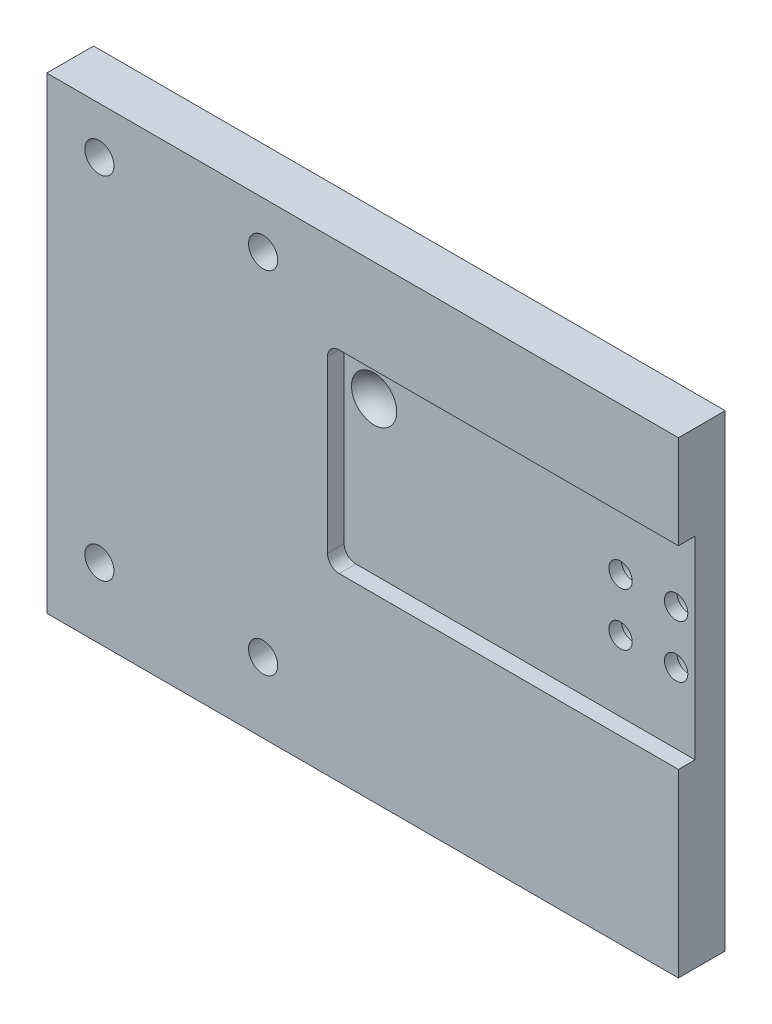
ISO-10303-21;
HEADER;
FILE_DESCRIPTION(('STEP AP214'),'2;1');
FILE_NAME('part.step','',(''),(''),'','','');
FILE_SCHEMA(('AUTOMOTIVE_DESIGN { 1 0 10303 214 1 1 1 1 }'));
ENDSEC;
DATA;
#1=APPLICATION_CONTEXT('core data for automotive mechanical design processes');
#2=APPLICATION_PROTOCOL_DEFINITION('international standard','automotive_design',2000,#1);
#3=PRODUCT_CONTEXT('',#1,'mechanical');
#4=PRODUCT('Part','Part','',(#3));
#5=PRODUCT_RELATED_PRODUCT_CATEGORY('part','',(#4));
#6=PRODUCT_DEFINITION_FORMATION('','',#4);
#7=PRODUCT_DEFINITION_CONTEXT('part definition',#1,'design');
#8=PRODUCT_DEFINITION('design','',#6,#7);
#9=PRODUCT_DEFINITION_SHAPE('','',#8);
#10=(LENGTH_UNIT() NAMED_UNIT(*) SI_UNIT(.MILLI.,.METRE.));
#11=(NAMED_UNIT(*) PLANE_ANGLE_UNIT() SI_UNIT($,.RADIAN.));
#12=(NAMED_UNIT(*) SI_UNIT($,.STERADIAN.) SOLID_ANGLE_UNIT());
#13=UNCERTAINTY_MEASURE_WITH_UNIT(LENGTH_MEASURE(1.E-05),#10,'distance_accuracy_value','');
#14=(GEOMETRIC_REPRESENTATION_CONTEXT(3) GLOBAL_UNCERTAINTY_ASSIGNED_CONTEXT((#13)) GLOBAL_UNIT_ASSIGNED_CONTEXT((#10,
#11,#12)) REPRESENTATION_CONTEXT('',''));
#15=CARTESIAN_POINT('',(0.,0.,0.));
#16=DIRECTION('',(0.,0.,1.));
#17=DIRECTION('',(1.,0.,0.));
#18=AXIS2_PLACEMENT_3D('',#15,#16,#17);
#19=CARTESIAN_POINT('',(0.,0.,1.8288));
#20=DIRECTION('',(0.,0.,-1.));
#21=DIRECTION('',(-1.,0.,0.));
#22=AXIS2_PLACEMENT_3D('',#19,#20,#21);
#23=PLANE('',#22);
#24=DIRECTION('',(0.,-1.,0.));
#25=VECTOR('',#24,1.);
#26=CARTESIAN_POINT('',(76.2,49.022,1.8288));
#27=LINE('',#26,#25);
#28=CARTESIAN_POINT('',(76.2,98.425,1.8288));
#29=VERTEX_POINT('',#28);
#30=CARTESIAN_POINT('',(76.2,52.197,1.8288));
#31=VERTEX_POINT('',#30);
#32=EDGE_CURVE('E116',#29,#31,#27,.T.);
#33=ORIENTED_EDGE('',*,*,#32,.T.);
#34=CARTESIAN_POINT('',(79.375,52.197,1.8288));
#35=DIRECTION('',(0.,0.,-1.));
#36=DIRECTION('',(-1.,0.,0.));
#37=AXIS2_PLACEMENT_3D('',#34,#35,#36);
#38=CIRCLE('',#37,3.175);
#39=CARTESIAN_POINT('',(79.375,49.022,1.8288));
#40=VERTEX_POINT('',#39);
#41=EDGE_CURVE('E228',#31,#40,#38,.F.);
#42=ORIENTED_EDGE('',*,*,#41,.T.);
#43=DIRECTION('',(1.,0.,0.));
#44=VECTOR('',#43,1.);
#45=CARTESIAN_POINT('',(171.45,49.022,1.8288));
#46=LINE('',#45,#44);
#47=CARTESIAN_POINT('',(171.45,49.022,1.8288));
#48=VERTEX_POINT('',#47);
#49=EDGE_CURVE('E123',#40,#48,#46,.T.);
#50=ORIENTED_EDGE('',*,*,#49,.T.);
#51=DIRECTION('',(0.,1.,0.));
#52=VECTOR('',#51,1.);
#53=CARTESIAN_POINT('',(171.45,49.022,1.8288));
#54=LINE('',#53,#52);
#55=CARTESIAN_POINT('',(171.45,101.6,1.8288));
#56=VERTEX_POINT('',#55);
#57=EDGE_CURVE('E117',#48,#56,#54,.T.);
#58=ORIENTED_EDGE('',*,*,#57,.T.);
#59=DIRECTION('',(-1.,0.,0.));
#60=VECTOR('',#59,1.);
#61=CARTESIAN_POINT('',(76.2,101.6,1.8288));
#62=LINE('',#61,#60);
#63=CARTESIAN_POINT('',(79.375,101.6,1.8288));
#64=VERTEX_POINT('',#63);
#65=EDGE_CURVE('E109',#56,#64,#62,.T.);
#66=ORIENTED_EDGE('',*,*,#65,.T.);
#67=CARTESIAN_POINT('',(79.375,98.425,1.8288));
#68=DIRECTION('',(0.,0.,-1.));
#69=DIRECTION('',(-1.,0.,0.));
#70=AXIS2_PLACEMENT_3D('',#67,#68,#69);
#71=CIRCLE('',#70,3.175);
#72=EDGE_CURVE('E226',#64,#29,#71,.F.);
#73=ORIENTED_EDGE('',*,*,#72,.T.);
#74=EDGE_LOOP('',(#33,#42,#50,#58,#66,#73));
#75=FACE_BOUND('',#74,.T.);
#76=CARTESIAN_POINT('',(151.2062,82.4484,1.8288));
#77=DIRECTION('',(0.,0.,-1.));
#78=DIRECTION('',(-1.,0.,0.));
#79=AXIS2_PLACEMENT_3D('',#76,#77,#78);
#80=CIRCLE('',#79,3.175);
#81=CARTESIAN_POINT('',(148.0312,82.4484,1.8288));
#82=VERTEX_POINT('',#81);
#83=EDGE_CURVE('E135',#82,#82,#80,.T.);
#84=ORIENTED_EDGE('',*,*,#83,.T.);
#85=EDGE_LOOP('',(#84));
#86=FACE_BOUND('',#85,.T.);
#87=CARTESIAN_POINT('',(166.2938,82.4484,1.8288));
#88=DIRECTION('',(0.,0.,-1.));
#89=DIRECTION('',(-1.,0.,0.));
#90=AXIS2_PLACEMENT_3D('',#87,#88,#89);
#91=CIRCLE('',#90,3.17499999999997);
#92=CARTESIAN_POINT('',(163.1188,82.4484,1.8288));
#93=VERTEX_POINT('',#92);
#94=EDGE_CURVE('E140',#93,#93,#91,.T.);
#95=ORIENTED_EDGE('',*,*,#94,.T.);
#96=EDGE_LOOP('',(#95));
#97=FACE_BOUND('',#96,.T.);
#98=CARTESIAN_POINT('',(166.2938,68.1736,1.8288));
#99=DIRECTION('',(0.,0.,-1.));
#100=DIRECTION('',(-1.,0.,0.));
#101=AXIS2_PLACEMENT_3D('',#98,#99,#100);
#102=CIRCLE('',#101,3.17499999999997);
#103=CARTESIAN_POINT('',(163.1188,68.1736,1.8288));
#104=VERTEX_POINT('',#103);
#105=EDGE_CURVE('E143',#104,#104,#102,.T.);
#106=ORIENTED_EDGE('',*,*,#105,.T.);
#107=EDGE_LOOP('',(#106));
#108=FACE_BOUND('',#107,.T.);
#109=CARTESIAN_POINT('',(151.2062,68.1736,1.8288));
#110=DIRECTION('',(0.,0.,-1.));
#111=DIRECTION('',(-1.,0.,0.));
#112=AXIS2_PLACEMENT_3D('',#109,#110,#111);
#113=CIRCLE('',#112,3.175);
#114=CARTESIAN_POINT('',(148.0312,68.1736,1.8288));
#115=VERTEX_POINT('',#114);
#116=EDGE_CURVE('E146',#115,#115,#113,.T.);
#117=ORIENTED_EDGE('',*,*,#116,.T.);
#118=EDGE_LOOP('',(#117));
#119=FACE_BOUND('',#118,.T.);
#120=CARTESIAN_POINT('',(84.328,90.3097,1.8288));
#121=DIRECTION('',(0.,0.,-1.));
#122=DIRECTION('',(-1.,0.,0.));
#123=AXIS2_PLACEMENT_3D('',#120,#121,#122);
#124=CIRCLE('',#123,6.13377131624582);
#125=CARTESIAN_POINT('',(78.1942286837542,90.3097,1.8288));
#126=VERTEX_POINT('',#125);
#127=EDGE_CURVE('E37',#126,#126,#124,.F.);
#128=ORIENTED_EDGE('',*,*,#127,.F.);
#129=EDGE_LOOP('',(#128));
#130=FACE_BOUND('',#129,.T.);
#131=ADVANCED_FACE('F33',(#75,#86,#97,#108,#119,#130),#23,.F.);
#132=CARTESIAN_POINT('',(151.2062,82.4484,6.35));
#133=DIRECTION('',(0.,0.,-1.));
#134=DIRECTION('',(-1.,0.,0.));
#135=AXIS2_PLACEMENT_3D('',#132,#133,#134);
#136=CYLINDRICAL_SURFACE('',#135,3.175);
#137=ORIENTED_EDGE('',*,*,#83,.F.);
#138=EDGE_LOOP('',(#137));
#139=FACE_BOUND('',#138,.T.);
#140=CARTESIAN_POINT('',(151.2062,82.4484,-1.5748));
#141=DIRECTION('',(0.,0.,-1.));
#142=DIRECTION('',(-1.,0.,0.));
#143=AXIS2_PLACEMENT_3D('',#140,#141,#142);
#144=CIRCLE('',#143,3.175);
#145=CARTESIAN_POINT('',(148.0312,82.4484,-1.5748));
#146=VERTEX_POINT('',#145);
#147=EDGE_CURVE('E250',#146,#146,#144,.T.);
#148=ORIENTED_EDGE('',*,*,#147,.T.);
#149=EDGE_LOOP('',(#148));
#150=FACE_BOUND('',#149,.T.);
#151=ADVANCED_FACE('F291',(#139,#150),#136,.F.);
#152=CARTESIAN_POINT('',(166.2938,82.4484,6.35));
#153=DIRECTION('',(0.,0.,-1.));
#154=DIRECTION('',(-1.,0.,0.));
#155=AXIS2_PLACEMENT_3D('',#152,#153,#154);
#156=CYLINDRICAL_SURFACE('',#155,3.17499999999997);
#157=ORIENTED_EDGE('',*,*,#94,.F.);
#158=EDGE_LOOP('',(#157));
#159=FACE_BOUND('',#158,.T.);
#160=CARTESIAN_POINT('',(166.2938,82.4484,-1.5748));
#161=DIRECTION('',(0.,0.,-1.));
#162=DIRECTION('',(-1.,0.,0.));
#163=AXIS2_PLACEMENT_3D('',#160,#161,#162);
#164=CIRCLE('',#163,3.17499999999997);
#165=CARTESIAN_POINT('',(163.1188,82.4484,-1.5748));
#166=VERTEX_POINT('',#165);
#167=EDGE_CURVE('E245',#166,#166,#164,.T.);
#168=ORIENTED_EDGE('',*,*,#167,.T.);
#169=EDGE_LOOP('',(#168));
#170=FACE_BOUND('',#169,.T.);
#171=ADVANCED_FACE('F296',(#159,#170),#156,.F.);
#172=CARTESIAN_POINT('',(166.2938,68.1736,6.35));
#173=DIRECTION('',(0.,0.,-1.));
#174=DIRECTION('',(-1.,0.,0.));
#175=AXIS2_PLACEMENT_3D('',#172,#173,#174);
#176=CYLINDRICAL_SURFACE('',#175,3.17499999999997);
#177=ORIENTED_EDGE('',*,*,#105,.F.);
#178=EDGE_LOOP('',(#177));
#179=FACE_BOUND('',#178,.T.);
#180=CARTESIAN_POINT('',(166.2938,68.1736,-1.5748));
#181=DIRECTION('',(0.,0.,-1.));
#182=DIRECTION('',(-1.,0.,0.));
#183=AXIS2_PLACEMENT_3D('',#180,#181,#182);
#184=CIRCLE('',#183,3.17499999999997);
#185=CARTESIAN_POINT('',(163.1188,68.1736,-1.5748));
#186=VERTEX_POINT('',#185);
#187=EDGE_CURVE('E240',#186,#186,#184,.T.);
#188=ORIENTED_EDGE('',*,*,#187,.T.);
#189=EDGE_LOOP('',(#188));
#190=FACE_BOUND('',#189,.T.);
#191=ADVANCED_FACE('F347',(#179,#190),#176,.F.);
#192=CARTESIAN_POINT('',(151.2062,68.1736,6.35));
#193=DIRECTION('',(0.,0.,-1.));
#194=DIRECTION('',(-1.,0.,0.));
#195=AXIS2_PLACEMENT_3D('',#192,#193,#194);
#196=CYLINDRICAL_SURFACE('',#195,3.175);
#197=ORIENTED_EDGE('',*,*,#116,.F.);
#198=EDGE_LOOP('',(#197));
#199=FACE_BOUND('',#198,.T.);
#200=CARTESIAN_POINT('',(151.2062,68.1736,-1.5748));
#201=DIRECTION('',(0.,0.,-1.));
#202=DIRECTION('',(-1.,0.,0.));
#203=AXIS2_PLACEMENT_3D('',#200,#201,#202);
#204=CIRCLE('',#203,3.175);
#205=CARTESIAN_POINT('',(148.0312,68.1736,-1.5748));
#206=VERTEX_POINT('',#205);
#207=EDGE_CURVE('E235',#206,#206,#204,.T.);
#208=ORIENTED_EDGE('',*,*,#207,.T.);
#209=EDGE_LOOP('',(#208));
#210=FACE_BOUND('',#209,.T.);
#211=ADVANCED_FACE('F351',(#199,#210),#196,.F.);
#212=CARTESIAN_POINT('',(0.,0.,6.35));
#213=DIRECTION('',(0.,0.,1.));
#214=DIRECTION('',(1.,0.,0.));
#215=AXIS2_PLACEMENT_3D('',#212,#213,#214);
#216=PLANE('',#215);
#217=DIRECTION('',(1.,0.,0.));
#218=VECTOR('',#217,1.);
#219=CARTESIAN_POINT('',(171.45,49.022,6.35));
#220=LINE('',#219,#218);
#221=CARTESIAN_POINT('',(79.375,49.022,6.35));
#222=VERTEX_POINT('',#221);
#223=CARTESIAN_POINT('',(171.45,49.022,6.35));
#224=VERTEX_POINT('',#223);
#225=EDGE_CURVE('E127',#222,#224,#220,.T.);
#226=ORIENTED_EDGE('',*,*,#225,.F.);
#227=CARTESIAN_POINT('',(79.375,52.197,6.35));
#228=DIRECTION('',(0.,0.,1.));
#229=DIRECTION('',(1.,0.,0.));
#230=AXIS2_PLACEMENT_3D('',#227,#228,#229);
#231=CIRCLE('',#230,3.175);
#232=CARTESIAN_POINT('',(76.2,52.197,6.35));
#233=VERTEX_POINT('',#232);
#234=EDGE_CURVE('E231',#222,#233,#231,.F.);
#235=ORIENTED_EDGE('',*,*,#234,.T.);
#236=DIRECTION('',(0.,-1.,0.));
#237=VECTOR('',#236,1.);
#238=CARTESIAN_POINT('',(76.2,49.022,6.35));
#239=LINE('',#238,#237);
#240=CARTESIAN_POINT('',(76.2,98.425,6.35));
#241=VERTEX_POINT('',#240);
#242=EDGE_CURVE('E432',#241,#233,#239,.T.);
#243=ORIENTED_EDGE('',*,*,#242,.F.);
#244=CARTESIAN_POINT('',(79.375,98.425,6.35));
#245=DIRECTION('',(0.,0.,1.));
#246=DIRECTION('',(1.,0.,0.));
#247=AXIS2_PLACEMENT_3D('',#244,#245,#246);
#248=CIRCLE('',#247,3.175);
#249=CARTESIAN_POINT('',(79.375,101.6,6.35));
#250=VERTEX_POINT('',#249);
#251=EDGE_CURVE('E49',#241,#250,#248,.F.);
#252=ORIENTED_EDGE('',*,*,#251,.T.);
#253=DIRECTION('',(-1.,0.,0.));
#254=VECTOR('',#253,1.);
#255=CARTESIAN_POINT('',(76.2,101.6,6.35));
#256=LINE('',#255,#254);
#257=CARTESIAN_POINT('',(171.45,101.6,6.35));
#258=VERTEX_POINT('',#257);
#259=EDGE_CURVE('E238',#258,#250,#256,.T.);
#260=ORIENTED_EDGE('',*,*,#259,.F.);
#261=DIRECTION('',(0.,1.,0.));
#262=VECTOR('',#261,1.);
#263=CARTESIAN_POINT('',(171.45,0.,6.35));
#264=LINE('',#263,#262);
#265=CARTESIAN_POINT('',(171.45,127.,6.35));
#266=VERTEX_POINT('',#265);
#267=EDGE_CURVE('E132',#258,#266,#264,.T.);
#268=ORIENTED_EDGE('',*,*,#267,.T.);
#269=DIRECTION('',(-1.,0.,0.));
#270=VECTOR('',#269,1.);
#271=CARTESIAN_POINT('',(171.45,127.,6.35));
#272=LINE('',#271,#270);
#273=CARTESIAN_POINT('',(0.,127.,6.35));
#274=VERTEX_POINT('',#273);
#275=EDGE_CURVE('E195',#266,#274,#272,.T.);
#276=ORIENTED_EDGE('',*,*,#275,.T.);
#277=DIRECTION('',(0.,-1.,0.));
#278=VECTOR('',#277,1.);
#279=CARTESIAN_POINT('',(0.,127.,6.35));
#280=LINE('',#279,#278);
#281=CARTESIAN_POINT('',(0.,0.,6.35));
#282=VERTEX_POINT('',#281);
#283=EDGE_CURVE('E186',#274,#282,#280,.T.);
#284=ORIENTED_EDGE('',*,*,#283,.T.);
#285=DIRECTION('',(1.,0.,0.));
#286=VECTOR('',#285,1.);
#287=CARTESIAN_POINT('',(0.,0.,6.35));
#288=LINE('',#287,#286);
#289=CARTESIAN_POINT('',(171.45,0.,6.35));
#290=VERTEX_POINT('',#289);
#291=EDGE_CURVE('E189',#282,#290,#288,.T.);
#292=ORIENTED_EDGE('',*,*,#291,.T.);
#293=EDGE_CURVE('E192',#290,#224,#264,.T.);
#294=ORIENTED_EDGE('',*,*,#293,.T.);
#295=EDGE_LOOP('',(#226,#235,#243,#252,#260,#268,#276,#284,#292,#294));
#296=FACE_BOUND('',#295,.T.);
#297=CARTESIAN_POINT('',(58.7248,114.3,6.35));
#298=DIRECTION('',(0.,0.,1.));
#299=DIRECTION('',(1.,0.,0.));
#300=AXIS2_PLACEMENT_3D('',#297,#298,#299);
#301=CIRCLE('',#300,3.9624);
#302=CARTESIAN_POINT('',(62.6872,114.3,6.35));
#303=VERTEX_POINT('',#302);
#304=EDGE_CURVE('E168',#303,#303,#301,.T.);
#305=ORIENTED_EDGE('',*,*,#304,.F.);
#306=EDGE_LOOP('',(#305));
#307=FACE_BOUND('',#306,.T.);
#308=CARTESIAN_POINT('',(14.2748,19.05,6.35));
#309=DIRECTION('',(0.,0.,1.));
#310=DIRECTION('',(1.,0.,0.));
#311=AXIS2_PLACEMENT_3D('',#308,#309,#310);
#312=CIRCLE('',#311,3.9624);
#313=CARTESIAN_POINT('',(18.2372,19.05,6.35));
#314=VERTEX_POINT('',#313);
#315=EDGE_CURVE('E180',#314,#314,#312,.T.);
#316=ORIENTED_EDGE('',*,*,#315,.F.);
#317=EDGE_LOOP('',(#316));
#318=FACE_BOUND('',#317,.T.);
#319=CARTESIAN_POINT('',(58.7248,19.05,6.35));
#320=DIRECTION('',(0.,0.,1.));
#321=DIRECTION('',(1.,0.,0.));
#322=AXIS2_PLACEMENT_3D('',#319,#320,#321);
#323=CIRCLE('',#322,3.9624);
#324=CARTESIAN_POINT('',(62.6872,19.05,6.35));
#325=VERTEX_POINT('',#324);
#326=EDGE_CURVE('E174',#325,#325,#323,.T.);
#327=ORIENTED_EDGE('',*,*,#326,.F.);
#328=EDGE_LOOP('',(#327));
#329=FACE_BOUND('',#328,.T.);
#330=CARTESIAN_POINT('',(14.2748,114.3,6.35));
#331=DIRECTION('',(0.,0.,1.));
#332=DIRECTION('',(1.,0.,0.));
#333=AXIS2_PLACEMENT_3D('',#330,#331,#332);
#334=CIRCLE('',#333,3.9624);
#335=CARTESIAN_POINT('',(18.2372,114.3,6.35));
#336=VERTEX_POINT('',#335);
#337=EDGE_CURVE('E162',#336,#336,#334,.T.);
#338=ORIENTED_EDGE('',*,*,#337,.F.);
#339=EDGE_LOOP('',(#338));
#340=FACE_BOUND('',#339,.T.);
#341=ADVANCED_FACE('F355',(#296,#307,#318,#329,#340),#216,.T.);
#342=CARTESIAN_POINT('',(0.,0.,-6.35));
#343=DIRECTION('',(0.,0.,1.));
#344=DIRECTION('',(1.,0.,0.));
#345=AXIS2_PLACEMENT_3D('',#342,#343,#344);
#346=PLANE('',#345);
#347=CARTESIAN_POINT('',(151.2062,82.4484,-6.35));
#348=DIRECTION('',(0.,0.,-1.));
#349=DIRECTION('',(-1.,0.,0.));
#350=AXIS2_PLACEMENT_3D('',#347,#348,#349);
#351=CIRCLE('',#350,4.76250000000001);
#352=CARTESIAN_POINT('',(146.4437,82.4484,-6.35));
#353=VERTEX_POINT('',#352);
#354=EDGE_CURVE('E455',#353,#353,#351,.T.);
#355=ORIENTED_EDGE('',*,*,#354,.F.);
#356=EDGE_LOOP('',(#355));
#357=FACE_BOUND('',#356,.T.);
#358=CARTESIAN_POINT('',(166.2938,82.4484,-6.35));
#359=DIRECTION('',(0.,0.,-1.));
#360=DIRECTION('',(-1.,0.,0.));
#361=AXIS2_PLACEMENT_3D('',#358,#359,#360);
#362=CIRCLE('',#361,4.76250000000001);
#363=CARTESIAN_POINT('',(161.5313,82.4484,-6.35));
#364=VERTEX_POINT('',#363);
#365=EDGE_CURVE('E253',#364,#364,#362,.T.);
#366=ORIENTED_EDGE('',*,*,#365,.F.);
#367=EDGE_LOOP('',(#366));
#368=FACE_BOUND('',#367,.T.);
#369=CARTESIAN_POINT('',(166.2938,68.1736,-6.35));
#370=DIRECTION('',(0.,0.,-1.));
#371=DIRECTION('',(-1.,0.,0.));
#372=AXIS2_PLACEMENT_3D('',#369,#370,#371);
#373=CIRCLE('',#372,4.76250000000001);
#374=CARTESIAN_POINT('',(161.5313,68.1736,-6.35));
#375=VERTEX_POINT('',#374);
#376=EDGE_CURVE('E248',#375,#375,#373,.T.);
#377=ORIENTED_EDGE('',*,*,#376,.F.);
#378=EDGE_LOOP('',(#377));
#379=FACE_BOUND('',#378,.T.);
#380=CARTESIAN_POINT('',(151.2062,68.1736,-6.35));
#381=DIRECTION('',(0.,0.,-1.));
#382=DIRECTION('',(-1.,0.,0.));
#383=AXIS2_PLACEMENT_3D('',#380,#381,#382);
#384=CIRCLE('',#383,4.76250000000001);
#385=CARTESIAN_POINT('',(146.4437,68.1736,-6.35));
#386=VERTEX_POINT('',#385);
#387=EDGE_CURVE('E243',#386,#386,#384,.T.);
#388=ORIENTED_EDGE('',*,*,#387,.F.);
#389=EDGE_LOOP('',(#388));
#390=FACE_BOUND('',#389,.T.);
#391=CARTESIAN_POINT('',(58.7248,114.3,-6.35));
#392=DIRECTION('',(0.,0.,1.));
#393=DIRECTION('',(1.,0.,0.));
#394=AXIS2_PLACEMENT_3D('',#391,#392,#393);
#395=CIRCLE('',#394,3.9624);
#396=CARTESIAN_POINT('',(62.6872,114.3,-6.35));
#397=VERTEX_POINT('',#396);
#398=EDGE_CURVE('E165',#397,#397,#395,.T.);
#399=ORIENTED_EDGE('',*,*,#398,.T.);
#400=EDGE_LOOP('',(#399));
#401=FACE_BOUND('',#400,.T.);
#402=CARTESIAN_POINT('',(14.2748,19.05,-6.35));
#403=DIRECTION('',(0.,0.,1.));
#404=DIRECTION('',(1.,0.,0.));
#405=AXIS2_PLACEMENT_3D('',#402,#403,#404);
#406=CIRCLE('',#405,3.9624);
#407=CARTESIAN_POINT('',(18.2372,19.05,-6.35));
#408=VERTEX_POINT('',#407);
#409=EDGE_CURVE('E177',#408,#408,#406,.T.);
#410=ORIENTED_EDGE('',*,*,#409,.T.);
#411=EDGE_LOOP('',(#410));
#412=FACE_BOUND('',#411,.T.);
#413=DIRECTION('',(0.,-1.,0.));
#414=VECTOR('',#413,1.);
#415=CARTESIAN_POINT('',(0.,127.,-6.35));
#416=LINE('',#415,#414);
#417=CARTESIAN_POINT('',(0.,127.,-6.35));
#418=VERTEX_POINT('',#417);
#419=CARTESIAN_POINT('',(0.,0.,-6.35));
#420=VERTEX_POINT('',#419);
#421=EDGE_CURVE('E183',#418,#420,#416,.T.);
#422=ORIENTED_EDGE('',*,*,#421,.F.);
#423=DIRECTION('',(-1.,0.,0.));
#424=VECTOR('',#423,1.);
#425=CARTESIAN_POINT('',(171.45,127.,-6.35));
#426=LINE('',#425,#424);
#427=CARTESIAN_POINT('',(171.45,127.,-6.35));
#428=VERTEX_POINT('',#427);
#429=EDGE_CURVE('E190',#428,#418,#426,.T.);
#430=ORIENTED_EDGE('',*,*,#429,.F.);
#431=DIRECTION('',(0.,1.,0.));
#432=VECTOR('',#431,1.);
#433=CARTESIAN_POINT('',(171.45,0.,-6.35));
#434=LINE('',#433,#432);
#435=CARTESIAN_POINT('',(171.45,0.,-6.35));
#436=VERTEX_POINT('',#435);
#437=EDGE_CURVE('E202',#436,#428,#434,.T.);
#438=ORIENTED_EDGE('',*,*,#437,.F.);
#439=DIRECTION('',(1.,0.,0.));
#440=VECTOR('',#439,1.);
#441=CARTESIAN_POINT('',(0.,0.,-6.35));
#442=LINE('',#441,#440);
#443=EDGE_CURVE('E200',#420,#436,#442,.T.);
#444=ORIENTED_EDGE('',*,*,#443,.F.);
#445=EDGE_LOOP('',(#422,#430,#438,#444));
#446=FACE_BOUND('',#445,.T.);
#447=CARTESIAN_POINT('',(58.7248,19.05,-6.35));
#448=DIRECTION('',(0.,0.,1.));
#449=DIRECTION('',(1.,0.,0.));
#450=AXIS2_PLACEMENT_3D('',#447,#448,#449);
#451=CIRCLE('',#450,3.9624);
#452=CARTESIAN_POINT('',(62.6872,19.05,-6.35));
#453=VERTEX_POINT('',#452);
#454=EDGE_CURVE('E171',#453,#453,#451,.T.);
#455=ORIENTED_EDGE('',*,*,#454,.T.);
#456=EDGE_LOOP('',(#455));
#457=FACE_BOUND('',#456,.T.);
#458=CARTESIAN_POINT('',(14.2748,114.3,-6.35));
#459=DIRECTION('',(0.,0.,1.));
#460=DIRECTION('',(1.,0.,0.));
#461=AXIS2_PLACEMENT_3D('',#458,#459,#460);
#462=CIRCLE('',#461,3.9624);
#463=CARTESIAN_POINT('',(18.2372,114.3,-6.35));
#464=VERTEX_POINT('',#463);
#465=EDGE_CURVE('E161',#464,#464,#462,.T.);
#466=ORIENTED_EDGE('',*,*,#465,.T.);
#467=EDGE_LOOP('',(#466));
#468=FACE_BOUND('',#467,.T.);
#469=ADVANCED_FACE('F375',(#357,#368,#379,#390,#401,#412,#446,#457,#468),#346,.F.);
#470=CARTESIAN_POINT('',(0.,127.,6.35));
#471=DIRECTION('',(1.,0.,0.));
#472=DIRECTION('',(0.,0.,-1.));
#473=AXIS2_PLACEMENT_3D('',#470,#471,#472);
#474=PLANE('',#473);
#475=ORIENTED_EDGE('',*,*,#421,.T.);
#476=DIRECTION('',(0.,0.,-1.));
#477=VECTOR('',#476,1.);
#478=CARTESIAN_POINT('',(0.,0.,6.35));
#479=LINE('',#478,#477);
#480=EDGE_CURVE('E213',#282,#420,#479,.T.);
#481=ORIENTED_EDGE('',*,*,#480,.F.);
#482=ORIENTED_EDGE('',*,*,#283,.F.);
#483=DIRECTION('',(0.,0.,-1.));
#484=VECTOR('',#483,1.);
#485=CARTESIAN_POINT('',(0.,127.,6.35));
#486=LINE('',#485,#484);
#487=EDGE_CURVE('E197',#274,#418,#486,.T.);
#488=ORIENTED_EDGE('',*,*,#487,.T.);
#489=EDGE_LOOP('',(#475,#481,#482,#488));
#490=FACE_BOUND('',#489,.T.);
#491=ADVANCED_FACE('F378',(#490),#474,.F.);
#492=CARTESIAN_POINT('',(0.,0.,6.35));
#493=DIRECTION('',(0.,1.,0.));
#494=DIRECTION('',(0.,0.,1.));
#495=AXIS2_PLACEMENT_3D('',#492,#493,#494);
#496=PLANE('',#495);
#497=CARTESIAN_POINT('',(126.2126,0.,0.));
#498=DIRECTION('',(0.,-1.,0.));
#499=DIRECTION('',(0.,0.,-1.));
#500=AXIS2_PLACEMENT_3D('',#497,#498,#499);
#501=CIRCLE('',#500,3.175);
#502=CARTESIAN_POINT('',(126.2126,0.,-3.175));
#503=VERTEX_POINT('',#502);
#504=EDGE_CURVE('E149',#503,#503,#501,.T.);
#505=ORIENTED_EDGE('',*,*,#504,.F.);
#506=EDGE_LOOP('',(#505));
#507=FACE_BOUND('',#506,.T.);
#508=CARTESIAN_POINT('',(100.8126,0.,0.));
#509=DIRECTION('',(0.,-1.,0.));
#510=DIRECTION('',(0.,0.,-1.));
#511=AXIS2_PLACEMENT_3D('',#508,#509,#510);
#512=CIRCLE('',#511,3.175);
#513=CARTESIAN_POINT('',(100.8126,0.,-3.175));
#514=VERTEX_POINT('',#513);
#515=EDGE_CURVE('E152',#514,#514,#512,.T.);
#516=ORIENTED_EDGE('',*,*,#515,.F.);
#517=EDGE_LOOP('',(#516));
#518=FACE_BOUND('',#517,.T.);
#519=CARTESIAN_POINT('',(75.4126,0.,0.));
#520=DIRECTION('',(0.,-1.,0.));
#521=DIRECTION('',(0.,0.,-1.));
#522=AXIS2_PLACEMENT_3D('',#519,#520,#521);
#523=CIRCLE('',#522,3.175);
#524=CARTESIAN_POINT('',(75.4126,0.,-3.175));
#525=VERTEX_POINT('',#524);
#526=EDGE_CURVE('E155',#525,#525,#523,.T.);
#527=ORIENTED_EDGE('',*,*,#526,.F.);
#528=EDGE_LOOP('',(#527));
#529=FACE_BOUND('',#528,.T.);
#530=CARTESIAN_POINT('',(50.0126,0.,0.));
#531=DIRECTION('',(0.,-1.,0.));
#532=DIRECTION('',(0.,0.,-1.));
#533=AXIS2_PLACEMENT_3D('',#530,#531,#532);
#534=CIRCLE('',#533,3.175);
#535=CARTESIAN_POINT('',(50.0126,0.,-3.175));
#536=VERTEX_POINT('',#535);
#537=EDGE_CURVE('E158',#536,#536,#534,.T.);
#538=ORIENTED_EDGE('',*,*,#537,.F.);
#539=EDGE_LOOP('',(#538));
#540=FACE_BOUND('',#539,.T.);
#541=ORIENTED_EDGE('',*,*,#443,.T.);
#542=DIRECTION('',(0.,0.,-1.));
#543=VECTOR('',#542,1.);
#544=CARTESIAN_POINT('',(171.45,0.,6.35));
#545=LINE('',#544,#543);
#546=EDGE_CURVE('E210',#290,#436,#545,.T.);
#547=ORIENTED_EDGE('',*,*,#546,.F.);
#548=ORIENTED_EDGE('',*,*,#291,.F.);
#549=ORIENTED_EDGE('',*,*,#480,.T.);
#550=EDGE_LOOP('',(#541,#547,#548,#549));
#551=FACE_BOUND('',#550,.T.);
#552=ADVANCED_FACE('F385',(#507,#518,#529,#540,#551),#496,.F.);
#553=CARTESIAN_POINT('',(171.45,0.,6.35));
#554=DIRECTION('',(-1.,0.,0.));
#555=DIRECTION('',(0.,0.,1.));
#556=AXIS2_PLACEMENT_3D('',#553,#554,#555);
#557=PLANE('',#556);
#558=ORIENTED_EDGE('',*,*,#57,.F.);
#559=DIRECTION('',(0.,0.,1.));
#560=VECTOR('',#559,1.);
#561=CARTESIAN_POINT('',(171.45,49.022,1.8288));
#562=LINE('',#561,#560);
#563=EDGE_CURVE('E133',#48,#224,#562,.T.);
#564=ORIENTED_EDGE('',*,*,#563,.T.);
#565=ORIENTED_EDGE('',*,*,#293,.F.);
#566=ORIENTED_EDGE('',*,*,#546,.T.);
#567=ORIENTED_EDGE('',*,*,#437,.T.);
#568=DIRECTION('',(0.,0.,-1.));
#569=VECTOR('',#568,1.);
#570=CARTESIAN_POINT('',(171.45,127.,6.35));
#571=LINE('',#570,#569);
#572=EDGE_CURVE('E207',#266,#428,#571,.T.);
#573=ORIENTED_EDGE('',*,*,#572,.F.);
#574=ORIENTED_EDGE('',*,*,#267,.F.);
#575=DIRECTION('',(0.,0.,1.));
#576=VECTOR('',#575,1.);
#577=CARTESIAN_POINT('',(171.45,101.6,1.8288));
#578=LINE('',#577,#576);
#579=EDGE_CURVE('E113',#56,#258,#578,.T.);
#580=ORIENTED_EDGE('',*,*,#579,.F.);
#581=EDGE_LOOP('',(#558,#564,#565,#566,#567,#573,#574,#580));
#582=FACE_BOUND('',#581,.T.);
#583=ADVANCED_FACE('F130',(#582),#557,.F.);
#584=CARTESIAN_POINT('',(171.45,127.,6.35));
#585=DIRECTION('',(0.,-1.,0.));
#586=DIRECTION('',(1.,0.,0.));
#587=AXIS2_PLACEMENT_3D('',#584,#585,#586);
#588=PLANE('',#587);
#589=ORIENTED_EDGE('',*,*,#429,.T.);
#590=ORIENTED_EDGE('',*,*,#487,.F.);
#591=ORIENTED_EDGE('',*,*,#275,.F.);
#592=ORIENTED_EDGE('',*,*,#572,.T.);
#593=EDGE_LOOP('',(#589,#590,#591,#592));
#594=FACE_BOUND('',#593,.T.);
#595=ADVANCED_FACE('F371',(#594),#588,.F.);
#596=CARTESIAN_POINT('',(14.2748,19.05,6.35));
#597=DIRECTION('',(0.,0.,-1.));
#598=DIRECTION('',(-1.,0.,0.));
#599=AXIS2_PLACEMENT_3D('',#596,#597,#598);
#600=CYLINDRICAL_SURFACE('',#599,3.9624);
#601=ORIENTED_EDGE('',*,*,#315,.T.);
#602=EDGE_LOOP('',(#601));
#603=FACE_BOUND('',#602,.T.);
#604=ORIENTED_EDGE('',*,*,#409,.F.);
#605=EDGE_LOOP('',(#604));
#606=FACE_BOUND('',#605,.T.);
#607=ADVANCED_FACE('F367',(#603,#606),#600,.F.);
#608=CARTESIAN_POINT('',(58.7248,19.05,6.35));
#609=DIRECTION('',(0.,0.,-1.));
#610=DIRECTION('',(-1.,0.,0.));
#611=AXIS2_PLACEMENT_3D('',#608,#609,#610);
#612=CYLINDRICAL_SURFACE('',#611,3.9624);
#613=ORIENTED_EDGE('',*,*,#326,.T.);
#614=EDGE_LOOP('',(#613));
#615=FACE_BOUND('',#614,.T.);
#616=ORIENTED_EDGE('',*,*,#454,.F.);
#617=EDGE_LOOP('',(#616));
#618=FACE_BOUND('',#617,.T.);
#619=ADVANCED_FACE('F363',(#615,#618),#612,.F.);
#620=CARTESIAN_POINT('',(58.7248,114.3,6.35));
#621=DIRECTION('',(0.,0.,-1.));
#622=DIRECTION('',(-1.,0.,0.));
#623=AXIS2_PLACEMENT_3D('',#620,#621,#622);
#624=CYLINDRICAL_SURFACE('',#623,3.9624);
#625=ORIENTED_EDGE('',*,*,#304,.T.);
#626=EDGE_LOOP('',(#625));
#627=FACE_BOUND('',#626,.T.);
#628=ORIENTED_EDGE('',*,*,#398,.F.);
#629=EDGE_LOOP('',(#628));
#630=FACE_BOUND('',#629,.T.);
#631=ADVANCED_FACE('F359',(#627,#630),#624,.F.);
#632=CARTESIAN_POINT('',(14.2748,114.3,6.35));
#633=DIRECTION('',(0.,0.,-1.));
#634=DIRECTION('',(-1.,0.,0.));
#635=AXIS2_PLACEMENT_3D('',#632,#633,#634);
#636=CYLINDRICAL_SURFACE('',#635,3.9624);
#637=ORIENTED_EDGE('',*,*,#337,.T.);
#638=EDGE_LOOP('',(#637));
#639=FACE_BOUND('',#638,.T.);
#640=ORIENTED_EDGE('',*,*,#465,.F.);
#641=EDGE_LOOP('',(#640));
#642=FACE_BOUND('',#641,.T.);
#643=ADVANCED_FACE('F342',(#639,#642),#636,.F.);
#644=CARTESIAN_POINT('',(50.0126,15.875,0.));
#645=DIRECTION('',(0.,-1.,0.));
#646=DIRECTION('',(0.,0.,-1.));
#647=AXIS2_PLACEMENT_3D('',#644,#645,#646);
#648=CYLINDRICAL_SURFACE('',#647,3.175);
#649=CARTESIAN_POINT('',(50.0126,14.097,0.));
#650=DIRECTION('',(0.,-1.,0.));
#651=DIRECTION('',(0.,0.,-1.));
#652=AXIS2_PLACEMENT_3D('',#649,#650,#651);
#653=CIRCLE('',#652,3.175);
#654=CARTESIAN_POINT('',(50.0126,14.097,-3.175));
#655=VERTEX_POINT('',#654);
#656=EDGE_CURVE('E11',#655,#655,#653,.F.);
#657=ORIENTED_EDGE('',*,*,#656,.T.);
#658=EDGE_LOOP('',(#657));
#659=FACE_BOUND('',#658,.T.);
#660=ORIENTED_EDGE('',*,*,#537,.T.);
#661=EDGE_LOOP('',(#660));
#662=FACE_BOUND('',#661,.T.);
#663=ADVANCED_FACE('F340',(#659,#662),#648,.F.);
#664=CARTESIAN_POINT('',(50.0126,15.875,0.));
#665=DIRECTION('',(0.,-1.,0.));
#666=DIRECTION('',(0.,0.,-1.));
#667=AXIS2_PLACEMENT_3D('',#664,#665,#666);
#668=PLANE('',#667);
#669=CARTESIAN_POINT('',(50.0126,15.875,0.));
#670=DIRECTION('',(0.,-1.,0.));
#671=DIRECTION('',(0.,0.,-1.));
#672=AXIS2_PLACEMENT_3D('',#669,#670,#671);
#673=CIRCLE('',#672,0.215911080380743);
#674=CARTESIAN_POINT('',(50.0126,15.875,-0.21591108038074));
#675=VERTEX_POINT('',#674);
#676=EDGE_CURVE('E42',#675,#675,#673,.T.);
#677=ORIENTED_EDGE('',*,*,#676,.T.);
#678=EDGE_LOOP('',(#677));
#679=FACE_BOUND('',#678,.T.);
#680=ADVANCED_FACE('F275',(#679),#668,.T.);
#681=CARTESIAN_POINT('',(75.4126,15.875,0.));
#682=DIRECTION('',(0.,-1.,0.));
#683=DIRECTION('',(0.,0.,-1.));
#684=AXIS2_PLACEMENT_3D('',#681,#682,#683);
#685=CYLINDRICAL_SURFACE('',#684,3.175);
#686=CARTESIAN_POINT('',(75.4126,14.097,0.));
#687=DIRECTION('',(0.,-1.,0.));
#688=DIRECTION('',(0.,0.,-1.));
#689=AXIS2_PLACEMENT_3D('',#686,#687,#688);
#690=CIRCLE('',#689,3.175);
#691=CARTESIAN_POINT('',(75.4126,14.097,-3.175));
#692=VERTEX_POINT('',#691);
#693=EDGE_CURVE('E269',#692,#692,#690,.F.);
#694=ORIENTED_EDGE('',*,*,#693,.T.);
#695=EDGE_LOOP('',(#694));
#696=FACE_BOUND('',#695,.T.);
#697=ORIENTED_EDGE('',*,*,#526,.T.);
#698=EDGE_LOOP('',(#697));
#699=FACE_BOUND('',#698,.T.);
#700=ADVANCED_FACE('F333',(#696,#699),#685,.F.);
#701=CARTESIAN_POINT('',(75.4126,15.875,0.));
#702=DIRECTION('',(0.,-1.,0.));
#703=DIRECTION('',(0.,0.,-1.));
#704=AXIS2_PLACEMENT_3D('',#701,#702,#703);
#705=PLANE('',#704);
#706=CARTESIAN_POINT('',(75.4126,15.875,0.));
#707=DIRECTION('',(0.,-1.,0.));
#708=DIRECTION('',(0.,0.,-1.));
#709=AXIS2_PLACEMENT_3D('',#706,#707,#708);
#710=CIRCLE('',#709,0.215911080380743);
#711=CARTESIAN_POINT('',(75.4126,15.875,-0.21591108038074));
#712=VERTEX_POINT('',#711);
#713=EDGE_CURVE('E266',#712,#712,#710,.T.);
#714=ORIENTED_EDGE('',*,*,#713,.T.);
#715=EDGE_LOOP('',(#714));
#716=FACE_BOUND('',#715,.T.);
#717=ADVANCED_FACE('F329',(#716),#705,.T.);
#718=CARTESIAN_POINT('',(100.8126,15.875,0.));
#719=DIRECTION('',(0.,-1.,0.));
#720=DIRECTION('',(0.,0.,-1.));
#721=AXIS2_PLACEMENT_3D('',#718,#719,#720);
#722=CYLINDRICAL_SURFACE('',#721,3.175);
#723=CARTESIAN_POINT('',(100.8126,14.097,0.));
#724=DIRECTION('',(0.,-1.,0.));
#725=DIRECTION('',(0.,0.,-1.));
#726=AXIS2_PLACEMENT_3D('',#723,#724,#725);
#727=CIRCLE('',#726,3.175);
#728=CARTESIAN_POINT('',(100.8126,14.097,-3.175));
#729=VERTEX_POINT('',#728);
#730=EDGE_CURVE('E263',#729,#729,#727,.F.);
#731=ORIENTED_EDGE('',*,*,#730,.T.);
#732=EDGE_LOOP('',(#731));
#733=FACE_BOUND('',#732,.T.);
#734=ORIENTED_EDGE('',*,*,#515,.T.);
#735=EDGE_LOOP('',(#734));
#736=FACE_BOUND('',#735,.T.);
#737=ADVANCED_FACE('F325',(#733,#736),#722,.F.);
#738=CARTESIAN_POINT('',(100.8126,15.875,0.));
#739=DIRECTION('',(0.,-1.,0.));
#740=DIRECTION('',(0.,0.,-1.));
#741=AXIS2_PLACEMENT_3D('',#738,#739,#740);
#742=PLANE('',#741);
#743=CARTESIAN_POINT('',(100.8126,15.875,0.));
#744=DIRECTION('',(0.,-1.,0.));
#745=DIRECTION('',(0.,0.,-1.));
#746=AXIS2_PLACEMENT_3D('',#743,#744,#745);
#747=CIRCLE('',#746,0.215911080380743);
#748=CARTESIAN_POINT('',(100.8126,15.875,-0.21591108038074));
#749=VERTEX_POINT('',#748);
#750=EDGE_CURVE('E260',#749,#749,#747,.T.);
#751=ORIENTED_EDGE('',*,*,#750,.T.);
#752=EDGE_LOOP('',(#751));
#753=FACE_BOUND('',#752,.T.);
#754=ADVANCED_FACE('F321',(#753),#742,.T.);
#755=CARTESIAN_POINT('',(126.2126,15.875,0.));
#756=DIRECTION('',(0.,-1.,0.));
#757=DIRECTION('',(0.,0.,-1.));
#758=AXIS2_PLACEMENT_3D('',#755,#756,#757);
#759=CYLINDRICAL_SURFACE('',#758,3.175);
#760=CARTESIAN_POINT('',(126.2126,14.097,0.));
#761=DIRECTION('',(0.,-1.,0.));
#762=DIRECTION('',(0.,0.,-1.));
#763=AXIS2_PLACEMENT_3D('',#760,#761,#762);
#764=CIRCLE('',#763,3.175);
#765=CARTESIAN_POINT('',(126.2126,14.097,-3.175));
#766=VERTEX_POINT('',#765);
#767=EDGE_CURVE('E257',#766,#766,#764,.F.);
#768=ORIENTED_EDGE('',*,*,#767,.T.);
#769=EDGE_LOOP('',(#768));
#770=FACE_BOUND('',#769,.T.);
#771=ORIENTED_EDGE('',*,*,#504,.T.);
#772=EDGE_LOOP('',(#771));
#773=FACE_BOUND('',#772,.T.);
#774=ADVANCED_FACE('F317',(#770,#773),#759,.F.);
#775=CARTESIAN_POINT('',(126.2126,15.875,0.));
#776=DIRECTION('',(0.,-1.,0.));
#777=DIRECTION('',(0.,0.,-1.));
#778=AXIS2_PLACEMENT_3D('',#775,#776,#777);
#779=PLANE('',#778);
#780=CARTESIAN_POINT('',(126.2126,15.875,0.));
#781=DIRECTION('',(0.,-1.,0.));
#782=DIRECTION('',(0.,0.,-1.));
#783=AXIS2_PLACEMENT_3D('',#780,#781,#782);
#784=CIRCLE('',#783,0.215911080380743);
#785=CARTESIAN_POINT('',(126.2126,15.875,-0.21591108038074));
#786=VERTEX_POINT('',#785);
#787=EDGE_CURVE('E234',#786,#786,#784,.T.);
#788=ORIENTED_EDGE('',*,*,#787,.T.);
#789=EDGE_LOOP('',(#788));
#790=FACE_BOUND('',#789,.T.);
#791=ADVANCED_FACE('F307',(#790),#779,.T.);
#792=CARTESIAN_POINT('',(171.45,49.022,1.8288));
#793=DIRECTION('',(0.,-1.,0.));
#794=DIRECTION('',(0.,0.,-1.));
#795=AXIS2_PLACEMENT_3D('',#792,#793,#794);
#796=PLANE('',#795);
#797=ORIENTED_EDGE('',*,*,#49,.F.);
#798=DIRECTION('',(0.,0.,1.));
#799=VECTOR('',#798,1.);
#800=CARTESIAN_POINT('',(79.375,49.022,6.35));
#801=LINE('',#800,#799);
#802=EDGE_CURVE('E216',#40,#222,#801,.T.);
#803=ORIENTED_EDGE('',*,*,#802,.T.);
#804=ORIENTED_EDGE('',*,*,#225,.T.);
#805=ORIENTED_EDGE('',*,*,#563,.F.);
#806=EDGE_LOOP('',(#797,#803,#804,#805));
#807=FACE_BOUND('',#806,.T.);
#808=ADVANCED_FACE('F303',(#807),#796,.F.);
#809=CARTESIAN_POINT('',(76.2,49.022,1.8288));
#810=DIRECTION('',(-1.,0.,0.));
#811=DIRECTION('',(0.,0.,1.));
#812=AXIS2_PLACEMENT_3D('',#809,#810,#811);
#813=PLANE('',#812);
#814=ORIENTED_EDGE('',*,*,#242,.T.);
#815=DIRECTION('',(0.,0.,1.));
#816=VECTOR('',#815,1.);
#817=CARTESIAN_POINT('',(76.2,52.197,1.8288));
#818=LINE('',#817,#816);
#819=EDGE_CURVE('E224',#233,#31,#818,.F.);
#820=ORIENTED_EDGE('',*,*,#819,.T.);
#821=ORIENTED_EDGE('',*,*,#32,.F.);
#822=DIRECTION('',(0.,0.,1.));
#823=VECTOR('',#822,1.);
#824=CARTESIAN_POINT('',(76.2,98.425,6.35));
#825=LINE('',#824,#823);
#826=EDGE_CURVE('E221',#29,#241,#825,.T.);
#827=ORIENTED_EDGE('',*,*,#826,.T.);
#828=EDGE_LOOP('',(#814,#820,#821,#827));
#829=FACE_BOUND('',#828,.T.);
#830=ADVANCED_FACE('F306',(#829),#813,.F.);
#831=CARTESIAN_POINT('',(76.2,101.6,1.8288));
#832=DIRECTION('',(0.,1.,0.));
#833=DIRECTION('',(0.,0.,1.));
#834=AXIS2_PLACEMENT_3D('',#831,#832,#833);
#835=PLANE('',#834);
#836=ORIENTED_EDGE('',*,*,#259,.T.);
#837=DIRECTION('',(0.,0.,1.));
#838=VECTOR('',#837,1.);
#839=CARTESIAN_POINT('',(79.375,101.6,1.8288));
#840=LINE('',#839,#838);
#841=EDGE_CURVE('E56',#250,#64,#840,.F.);
#842=ORIENTED_EDGE('',*,*,#841,.T.);
#843=ORIENTED_EDGE('',*,*,#65,.F.);
#844=ORIENTED_EDGE('',*,*,#579,.T.);
#845=EDGE_LOOP('',(#836,#842,#843,#844));
#846=FACE_BOUND('',#845,.T.);
#847=ADVANCED_FACE('F111',(#846),#835,.F.);
#848=CARTESIAN_POINT('',(79.375,52.197,1.8288));
#849=DIRECTION('',(0.,0.,-1.));
#850=DIRECTION('',(-1.,0.,0.));
#851=AXIS2_PLACEMENT_3D('',#848,#849,#850);
#852=CYLINDRICAL_SURFACE('',#851,3.175);
#853=ORIENTED_EDGE('',*,*,#41,.F.);
#854=ORIENTED_EDGE('',*,*,#819,.F.);
#855=ORIENTED_EDGE('',*,*,#234,.F.);
#856=ORIENTED_EDGE('',*,*,#802,.F.);
#857=EDGE_LOOP('',(#853,#854,#855,#856));
#858=FACE_BOUND('',#857,.T.);
#859=ADVANCED_FACE('F314',(#858),#852,.F.);
#860=CARTESIAN_POINT('',(79.375,98.425,1.8288));
#861=DIRECTION('',(0.,0.,-1.));
#862=DIRECTION('',(-1.,0.,0.));
#863=AXIS2_PLACEMENT_3D('',#860,#861,#862);
#864=CYLINDRICAL_SURFACE('',#863,3.175);
#865=ORIENTED_EDGE('',*,*,#72,.F.);
#866=ORIENTED_EDGE('',*,*,#841,.F.);
#867=ORIENTED_EDGE('',*,*,#251,.F.);
#868=ORIENTED_EDGE('',*,*,#826,.F.);
#869=EDGE_LOOP('',(#865,#866,#867,#868));
#870=FACE_BOUND('',#869,.T.);
#871=ADVANCED_FACE('F394',(#870),#864,.F.);
#872=CARTESIAN_POINT('',(151.2062,68.1736,-1.5748));
#873=DIRECTION('',(0.,0.,-1.));
#874=DIRECTION('',(-1.,0.,0.));
#875=AXIS2_PLACEMENT_3D('',#872,#873,#874);
#876=CYLINDRICAL_SURFACE('',#875,4.76250000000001);
#877=CARTESIAN_POINT('',(151.2062,68.1736,-1.5748));
#878=DIRECTION('',(0.,0.,-1.));
#879=DIRECTION('',(-1.,0.,0.));
#880=AXIS2_PLACEMENT_3D('',#877,#878,#879);
#881=CIRCLE('',#880,4.76250000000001);
#882=CARTESIAN_POINT('',(146.4437,68.1736,-1.5748));
#883=VERTEX_POINT('',#882);
#884=EDGE_CURVE('E239',#883,#883,#881,.T.);
#885=ORIENTED_EDGE('',*,*,#884,.F.);
#886=EDGE_LOOP('',(#885));
#887=FACE_BOUND('',#886,.T.);
#888=ORIENTED_EDGE('',*,*,#387,.T.);
#889=EDGE_LOOP('',(#888));
#890=FACE_BOUND('',#889,.T.);
#891=ADVANCED_FACE('F301',(#887,#890),#876,.F.);
#892=CARTESIAN_POINT('',(151.2062,68.1736,-1.5748));
#893=DIRECTION('',(0.,0.,-1.));
#894=DIRECTION('',(-1.,0.,0.));
#895=AXIS2_PLACEMENT_3D('',#892,#893,#894);
#896=PLANE('',#895);
#897=ORIENTED_EDGE('',*,*,#207,.F.);
#898=EDGE_LOOP('',(#897));
#899=FACE_BOUND('',#898,.T.);
#900=ORIENTED_EDGE('',*,*,#884,.T.);
#901=EDGE_LOOP('',(#900));
#902=FACE_BOUND('',#901,.T.);
#903=ADVANCED_FACE('F482',(#899,#902),#896,.T.);
#904=CARTESIAN_POINT('',(166.2938,68.1736,-1.5748));
#905=DIRECTION('',(0.,0.,-1.));
#906=DIRECTION('',(-1.,0.,0.));
#907=AXIS2_PLACEMENT_3D('',#904,#905,#906);
#908=CYLINDRICAL_SURFACE('',#907,4.76250000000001);
#909=CARTESIAN_POINT('',(166.2938,68.1736,-1.5748));
#910=DIRECTION('',(0.,0.,-1.));
#911=DIRECTION('',(-1.,0.,0.));
#912=AXIS2_PLACEMENT_3D('',#909,#910,#911);
#913=CIRCLE('',#912,4.76250000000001);
#914=CARTESIAN_POINT('',(161.5313,68.1736,-1.5748));
#915=VERTEX_POINT('',#914);
#916=EDGE_CURVE('E244',#915,#915,#913,.T.);
#917=ORIENTED_EDGE('',*,*,#916,.F.);
#918=EDGE_LOOP('',(#917));
#919=FACE_BOUND('',#918,.T.);
#920=ORIENTED_EDGE('',*,*,#376,.T.);
#921=EDGE_LOOP('',(#920));
#922=FACE_BOUND('',#921,.T.);
#923=ADVANCED_FACE('F487',(#919,#922),#908,.F.);
#924=CARTESIAN_POINT('',(166.2938,68.1736,-1.5748));
#925=DIRECTION('',(0.,0.,-1.));
#926=DIRECTION('',(-1.,0.,0.));
#927=AXIS2_PLACEMENT_3D('',#924,#925,#926);
#928=PLANE('',#927);
#929=ORIENTED_EDGE('',*,*,#187,.F.);
#930=EDGE_LOOP('',(#929));
#931=FACE_BOUND('',#930,.T.);
#932=ORIENTED_EDGE('',*,*,#916,.T.);
#933=EDGE_LOOP('',(#932));
#934=FACE_BOUND('',#933,.T.);
#935=ADVANCED_FACE('F494',(#931,#934),#928,.T.);
#936=CARTESIAN_POINT('',(166.2938,82.4484,-1.5748));
#937=DIRECTION('',(0.,0.,-1.));
#938=DIRECTION('',(-1.,0.,0.));
#939=AXIS2_PLACEMENT_3D('',#936,#937,#938);
#940=CYLINDRICAL_SURFACE('',#939,4.76250000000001);
#941=CARTESIAN_POINT('',(166.2938,82.4484,-1.5748));
#942=DIRECTION('',(0.,0.,-1.));
#943=DIRECTION('',(-1.,0.,0.));
#944=AXIS2_PLACEMENT_3D('',#941,#942,#943);
#945=CIRCLE('',#944,4.76250000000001);
#946=CARTESIAN_POINT('',(161.5313,82.4484,-1.5748));
#947=VERTEX_POINT('',#946);
#948=EDGE_CURVE('E249',#947,#947,#945,.T.);
#949=ORIENTED_EDGE('',*,*,#948,.F.);
#950=EDGE_LOOP('',(#949));
#951=FACE_BOUND('',#950,.T.);
#952=ORIENTED_EDGE('',*,*,#365,.T.);
#953=EDGE_LOOP('',(#952));
#954=FACE_BOUND('',#953,.T.);
#955=ADVANCED_FACE('F501',(#951,#954),#940,.F.);
#956=CARTESIAN_POINT('',(166.2938,82.4484,-1.5748));
#957=DIRECTION('',(0.,0.,-1.));
#958=DIRECTION('',(-1.,0.,0.));
#959=AXIS2_PLACEMENT_3D('',#956,#957,#958);
#960=PLANE('',#959);
#961=ORIENTED_EDGE('',*,*,#167,.F.);
#962=EDGE_LOOP('',(#961));
#963=FACE_BOUND('',#962,.T.);
#964=ORIENTED_EDGE('',*,*,#948,.T.);
#965=EDGE_LOOP('',(#964));
#966=FACE_BOUND('',#965,.T.);
#967=ADVANCED_FACE('F465',(#963,#966),#960,.T.);
#968=CARTESIAN_POINT('',(151.2062,82.4484,-1.5748));
#969=DIRECTION('',(0.,0.,-1.));
#970=DIRECTION('',(-1.,0.,0.));
#971=AXIS2_PLACEMENT_3D('',#968,#969,#970);
#972=CYLINDRICAL_SURFACE('',#971,4.76250000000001);
#973=CARTESIAN_POINT('',(151.2062,82.4484,-1.5748));
#974=DIRECTION('',(0.,0.,-1.));
#975=DIRECTION('',(-1.,0.,0.));
#976=AXIS2_PLACEMENT_3D('',#973,#974,#975);
#977=CIRCLE('',#976,4.76250000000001);
#978=CARTESIAN_POINT('',(146.4437,82.4484,-1.5748));
#979=VERTEX_POINT('',#978);
#980=EDGE_CURVE('E254',#979,#979,#977,.T.);
#981=ORIENTED_EDGE('',*,*,#980,.F.);
#982=EDGE_LOOP('',(#981));
#983=FACE_BOUND('',#982,.T.);
#984=ORIENTED_EDGE('',*,*,#354,.T.);
#985=EDGE_LOOP('',(#984));
#986=FACE_BOUND('',#985,.T.);
#987=ADVANCED_FACE('F462',(#983,#986),#972,.F.);
#988=CARTESIAN_POINT('',(151.2062,82.4484,-1.5748));
#989=DIRECTION('',(0.,0.,-1.));
#990=DIRECTION('',(-1.,0.,0.));
#991=AXIS2_PLACEMENT_3D('',#988,#989,#990);
#992=PLANE('',#991);
#993=ORIENTED_EDGE('',*,*,#147,.F.);
#994=EDGE_LOOP('',(#993));
#995=FACE_BOUND('',#994,.T.);
#996=ORIENTED_EDGE('',*,*,#980,.T.);
#997=EDGE_LOOP('',(#996));
#998=FACE_BOUND('',#997,.T.);
#999=ADVANCED_FACE('F402',(#995,#998),#992,.T.);
#1000=CARTESIAN_POINT('',(126.2126,15.875,0.));
#1001=DIRECTION('',(0.,-1.,0.));
#1002=DIRECTION('',(0.,0.,-1.));
#1003=AXIS2_PLACEMENT_3D('',#1000,#1001,#1002);
#1004=CONICAL_SURFACE('',#1003,0.215911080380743,1.02974425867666);
#1005=CARTESIAN_POINT('',(126.2126,14.097,-3.175));
#1006=CARTESIAN_POINT('',(126.2126,14.1155208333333,-3.1441761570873));
#1007=CARTESIAN_POINT('',(126.2126,14.1340416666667,-3.1133523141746));
#1008=CARTESIAN_POINT('',(126.2126,14.1710833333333,-3.05170462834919));
#1009=CARTESIAN_POINT('',(126.2126,14.1896041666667,-3.02088078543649));
#1010=CARTESIAN_POINT('',(126.2126,14.2266458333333,-2.95923309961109));
#1011=CARTESIAN_POINT('',(126.2126,14.2451666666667,-2.92840925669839));
#1012=CARTESIAN_POINT('',(126.2126,14.2822083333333,-2.86676157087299));
#1013=CARTESIAN_POINT('',(126.2126,14.3007291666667,-2.83593772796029));
#1014=CARTESIAN_POINT('',(126.2126,14.3377708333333,-2.77429004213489));
#1015=CARTESIAN_POINT('',(126.2126,14.3562916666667,-2.74346619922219));
#1016=CARTESIAN_POINT('',(126.2126,14.3933333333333,-2.68181851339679));
#1017=CARTESIAN_POINT('',(126.2126,14.4118541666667,-2.65099467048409));
#1018=CARTESIAN_POINT('',(126.2126,14.4488958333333,-2.58934698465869));
#1019=CARTESIAN_POINT('',(126.2126,14.4674166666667,-2.55852314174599));
#1020=CARTESIAN_POINT('',(126.2126,14.5044583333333,-2.49687545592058));
#1021=CARTESIAN_POINT('',(126.2126,14.5229791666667,-2.46605161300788));
#1022=CARTESIAN_POINT('',(126.2126,14.5600208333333,-2.40440392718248));
#1023=CARTESIAN_POINT('',(126.2126,14.5785416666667,-2.37358008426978));
#1024=CARTESIAN_POINT('',(126.2126,14.6155833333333,-2.31193239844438));
#1025=CARTESIAN_POINT('',(126.2126,14.6341041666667,-2.28110855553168));
#1026=CARTESIAN_POINT('',(126.2126,14.6711458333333,-2.21946086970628));
#1027=CARTESIAN_POINT('',(126.2126,14.6896666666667,-2.18863702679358));
#1028=CARTESIAN_POINT('',(126.2126,14.7267083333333,-2.12698934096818));
#1029=CARTESIAN_POINT('',(126.2126,14.7452291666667,-2.09616549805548));
#1030=CARTESIAN_POINT('',(126.2126,14.7822708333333,-2.03451781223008));
#1031=CARTESIAN_POINT('',(126.2126,14.8007916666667,-2.00369396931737));
#1032=CARTESIAN_POINT('',(126.2126,14.8378333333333,-1.94204628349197));
#1033=CARTESIAN_POINT('',(126.2126,14.8563541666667,-1.91122244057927));
#1034=CARTESIAN_POINT('',(126.2126,14.8933958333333,-1.84957475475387));
#1035=CARTESIAN_POINT('',(126.2126,14.9119166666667,-1.81875091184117));
#1036=CARTESIAN_POINT('',(126.2126,14.9489583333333,-1.75710322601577));
#1037=CARTESIAN_POINT('',(126.2126,14.9674791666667,-1.72627938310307));
#1038=CARTESIAN_POINT('',(126.2126,15.0045208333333,-1.66463169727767));
#1039=CARTESIAN_POINT('',(126.2126,15.0230416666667,-1.63380785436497));
#1040=CARTESIAN_POINT('',(126.2126,15.0600833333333,-1.57216016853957));
#1041=CARTESIAN_POINT('',(126.2126,15.0786041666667,-1.54133632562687));
#1042=CARTESIAN_POINT('',(126.2126,15.1156458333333,-1.47968863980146));
#1043=CARTESIAN_POINT('',(126.2126,15.1341666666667,-1.44886479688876));
#1044=CARTESIAN_POINT('',(126.2126,15.1712083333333,-1.38721711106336));
#1045=CARTESIAN_POINT('',(126.2126,15.1897291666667,-1.35639326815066));
#1046=CARTESIAN_POINT('',(126.2126,15.2267708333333,-1.29474558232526));
#1047=CARTESIAN_POINT('',(126.2126,15.2452916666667,-1.26392173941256));
#1048=CARTESIAN_POINT('',(126.2126,15.2823333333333,-1.20227405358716));
#1049=CARTESIAN_POINT('',(126.2126,15.3008541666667,-1.17145021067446));
#1050=CARTESIAN_POINT('',(126.2126,15.3378958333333,-1.10980252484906));
#1051=CARTESIAN_POINT('',(126.2126,15.3564166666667,-1.07897868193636));
#1052=CARTESIAN_POINT('',(126.2126,15.3934583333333,-1.01733099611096));
#1053=CARTESIAN_POINT('',(126.2126,15.4119791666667,-0.986507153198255));
#1054=CARTESIAN_POINT('',(126.2126,15.4490208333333,-0.924859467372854));
#1055=CARTESIAN_POINT('',(126.2126,15.4675416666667,-0.894035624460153));
#1056=CARTESIAN_POINT('',(126.2126,15.5045833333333,-0.832387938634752));
#1057=CARTESIAN_POINT('',(126.2126,15.5231041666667,-0.801564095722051));
#1058=CARTESIAN_POINT('',(126.2126,15.5601458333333,-0.73991640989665));
#1059=CARTESIAN_POINT('',(126.2126,15.5786666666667,-0.70909256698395));
#1060=CARTESIAN_POINT('',(126.2126,15.6157083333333,-0.647444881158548));
#1061=CARTESIAN_POINT('',(126.2126,15.6342291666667,-0.616621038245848));
#1062=CARTESIAN_POINT('',(126.2126,15.6712708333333,-0.554973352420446));
#1063=CARTESIAN_POINT('',(126.2126,15.6897916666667,-0.524149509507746));
#1064=CARTESIAN_POINT('',(126.2126,15.7268333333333,-0.462501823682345));
#1065=CARTESIAN_POINT('',(126.2126,15.7453541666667,-0.431677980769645));
#1066=CARTESIAN_POINT('',(126.2126,15.7823958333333,-0.370030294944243));
#1067=CARTESIAN_POINT('',(126.2126,15.8009166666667,-0.339206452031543));
#1068=CARTESIAN_POINT('',(126.2126,15.8379583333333,-0.277558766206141));
#1069=CARTESIAN_POINT('',(126.2126,15.8564791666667,-0.24673492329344));
#1070=CARTESIAN_POINT('',(126.2126,15.875,-0.21591108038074));
#1071=B_SPLINE_CURVE_WITH_KNOTS('',3,(#1005,#1006,#1007,#1008,#1009,#1010,#1011,#1012,#1013,
#1014,#1015,#1016,#1017,#1018,#1019,#1020,#1021,#1022,#1023,#1024,#1025,#1026,#1027,#1028,#1029,
#1030,#1031,#1032,#1033,#1034,#1035,#1036,#1037,#1038,#1039,#1040,#1041,#1042,#1043,#1044,#1045,
#1046,#1047,#1048,#1049,#1050,#1051,#1052,#1053,#1054,#1055,#1056,#1057,#1058,#1059,#1060,#1061,
#1062,#1063,#1064,#1065,#1066,#1067,#1068,#1069,#1070),.UNSPECIFIED.,.F.,.F.,(4,2,2,2,2,2,2,2,2,
2,2,2,2,2,2,2,2,2,2,2,2,2,2,2,2,2,2,2,2,2,2,2,4),(0.,0.107880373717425,0.215760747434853,
0.323641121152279,0.431521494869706,0.539401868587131,0.647282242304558,0.755162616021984,
0.86304298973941,0.970923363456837,1.07880373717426,1.18668411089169,1.29456448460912,
1.40244485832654,1.51032523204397,1.6182056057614,1.72608597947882,1.83396635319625,
1.94184672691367,2.0497271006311,2.15760747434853,2.26548784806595,2.37336822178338,
2.48124859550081,2.58912896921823,2.69700934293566,2.80488971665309,2.91277009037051,
3.02065046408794,3.12853083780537,3.23641121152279,3.34429158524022,3.45217195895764),.UNSPECIFIED.);
#1072=EDGE_CURVE('BSEAM399',#766,#786,#1071,.T.);
#1073=ORIENTED_EDGE('',*,*,#767,.F.);
#1074=ORIENTED_EDGE('',*,*,#787,.F.);
#1075=ORIENTED_EDGE('',*,*,#1072,.T.);
#1076=ORIENTED_EDGE('',*,*,#1072,.F.);
#1077=EDGE_LOOP('',(#1073,#1075,#1074,#1076));
#1078=FACE_BOUND('',#1077,.T.);
#1079=ADVANCED_FACE('F399',(#1078),#1004,.F.);
#1080=CARTESIAN_POINT('',(100.8126,15.875,0.));
#1081=DIRECTION('',(0.,-1.,0.));
#1082=DIRECTION('',(0.,0.,-1.));
#1083=AXIS2_PLACEMENT_3D('',#1080,#1081,#1082);
#1084=CONICAL_SURFACE('',#1083,0.215911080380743,1.02974425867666);
#1085=CARTESIAN_POINT('',(100.8126,14.097,-3.175));
#1086=CARTESIAN_POINT('',(100.8126,14.1155208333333,-3.1441761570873));
#1087=CARTESIAN_POINT('',(100.8126,14.1340416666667,-3.1133523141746));
#1088=CARTESIAN_POINT('',(100.8126,14.1710833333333,-3.05170462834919));
#1089=CARTESIAN_POINT('',(100.8126,14.1896041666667,-3.02088078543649));
#1090=CARTESIAN_POINT('',(100.8126,14.2266458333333,-2.95923309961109));
#1091=CARTESIAN_POINT('',(100.8126,14.2451666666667,-2.92840925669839));
#1092=CARTESIAN_POINT('',(100.8126,14.2822083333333,-2.86676157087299));
#1093=CARTESIAN_POINT('',(100.8126,14.3007291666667,-2.83593772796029));
#1094=CARTESIAN_POINT('',(100.8126,14.3377708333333,-2.77429004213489));
#1095=CARTESIAN_POINT('',(100.8126,14.3562916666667,-2.74346619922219));
#1096=CARTESIAN_POINT('',(100.8126,14.3933333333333,-2.68181851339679));
#1097=CARTESIAN_POINT('',(100.8126,14.4118541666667,-2.65099467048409));
#1098=CARTESIAN_POINT('',(100.8126,14.4488958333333,-2.58934698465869));
#1099=CARTESIAN_POINT('',(100.8126,14.4674166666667,-2.55852314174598));
#1100=CARTESIAN_POINT('',(100.8126,14.5044583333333,-2.49687545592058));
#1101=CARTESIAN_POINT('',(100.8126,14.5229791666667,-2.46605161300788));
#1102=CARTESIAN_POINT('',(100.8126,14.5600208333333,-2.40440392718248));
#1103=CARTESIAN_POINT('',(100.8126,14.5785416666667,-2.37358008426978));
#1104=CARTESIAN_POINT('',(100.8126,14.6155833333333,-2.31193239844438));
#1105=CARTESIAN_POINT('',(100.8126,14.6341041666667,-2.28110855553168));
#1106=CARTESIAN_POINT('',(100.8126,14.6711458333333,-2.21946086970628));
#1107=CARTESIAN_POINT('',(100.8126,14.6896666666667,-2.18863702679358));
#1108=CARTESIAN_POINT('',(100.8126,14.7267083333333,-2.12698934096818));
#1109=CARTESIAN_POINT('',(100.8126,14.7452291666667,-2.09616549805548));
#1110=CARTESIAN_POINT('',(100.8126,14.7822708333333,-2.03451781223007));
#1111=CARTESIAN_POINT('',(100.8126,14.8007916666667,-2.00369396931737));
#1112=CARTESIAN_POINT('',(100.8126,14.8378333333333,-1.94204628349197));
#1113=CARTESIAN_POINT('',(100.8126,14.8563541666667,-1.91122244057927));
#1114=CARTESIAN_POINT('',(100.8126,14.8933958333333,-1.84957475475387));
#1115=CARTESIAN_POINT('',(100.8126,14.9119166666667,-1.81875091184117));
#1116=CARTESIAN_POINT('',(100.8126,14.9489583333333,-1.75710322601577));
#1117=CARTESIAN_POINT('',(100.8126,14.9674791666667,-1.72627938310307));
#1118=CARTESIAN_POINT('',(100.8126,15.0045208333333,-1.66463169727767));
#1119=CARTESIAN_POINT('',(100.8126,15.0230416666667,-1.63380785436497));
#1120=CARTESIAN_POINT('',(100.8126,15.0600833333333,-1.57216016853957));
#1121=CARTESIAN_POINT('',(100.8126,15.0786041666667,-1.54133632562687));
#1122=CARTESIAN_POINT('',(100.8126,15.1156458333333,-1.47968863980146));
#1123=CARTESIAN_POINT('',(100.8126,15.1341666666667,-1.44886479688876));
#1124=CARTESIAN_POINT('',(100.8126,15.1712083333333,-1.38721711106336));
#1125=CARTESIAN_POINT('',(100.8126,15.1897291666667,-1.35639326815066));
#1126=CARTESIAN_POINT('',(100.8126,15.2267708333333,-1.29474558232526));
#1127=CARTESIAN_POINT('',(100.8126,15.2452916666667,-1.26392173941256));
#1128=CARTESIAN_POINT('',(100.8126,15.2823333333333,-1.20227405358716));
#1129=CARTESIAN_POINT('',(100.8126,15.3008541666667,-1.17145021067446));
#1130=CARTESIAN_POINT('',(100.8126,15.3378958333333,-1.10980252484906));
#1131=CARTESIAN_POINT('',(100.8126,15.3564166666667,-1.07897868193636));
#1132=CARTESIAN_POINT('',(100.8126,15.3934583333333,-1.01733099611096));
#1133=CARTESIAN_POINT('',(100.8126,15.4119791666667,-0.986507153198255));
#1134=CARTESIAN_POINT('',(100.8126,15.4490208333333,-0.924859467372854));
#1135=CARTESIAN_POINT('',(100.8126,15.4675416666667,-0.894035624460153));
#1136=CARTESIAN_POINT('',(100.8126,15.5045833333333,-0.832387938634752));
#1137=CARTESIAN_POINT('',(100.8126,15.5231041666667,-0.801564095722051));
#1138=CARTESIAN_POINT('',(100.8126,15.5601458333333,-0.73991640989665));
#1139=CARTESIAN_POINT('',(100.8126,15.5786666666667,-0.709092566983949));
#1140=CARTESIAN_POINT('',(100.8126,15.6157083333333,-0.647444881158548));
#1141=CARTESIAN_POINT('',(100.8126,15.6342291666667,-0.616621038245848));
#1142=CARTESIAN_POINT('',(100.8126,15.6712708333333,-0.554973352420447));
#1143=CARTESIAN_POINT('',(100.8126,15.6897916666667,-0.524149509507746));
#1144=CARTESIAN_POINT('',(100.8126,15.7268333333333,-0.462501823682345));
#1145=CARTESIAN_POINT('',(100.8126,15.7453541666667,-0.431677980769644));
#1146=CARTESIAN_POINT('',(100.8126,15.7823958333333,-0.370030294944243));
#1147=CARTESIAN_POINT('',(100.8126,15.8009166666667,-0.339206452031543));
#1148=CARTESIAN_POINT('',(100.8126,15.8379583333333,-0.277558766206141));
#1149=CARTESIAN_POINT('',(100.8126,15.8564791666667,-0.24673492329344));
#1150=CARTESIAN_POINT('',(100.8126,15.875,-0.21591108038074));
#1151=B_SPLINE_CURVE_WITH_KNOTS('',3,(#1085,#1086,#1087,#1088,#1089,#1090,#1091,#1092,#1093,
#1094,#1095,#1096,#1097,#1098,#1099,#1100,#1101,#1102,#1103,#1104,#1105,#1106,#1107,#1108,#1109,
#1110,#1111,#1112,#1113,#1114,#1115,#1116,#1117,#1118,#1119,#1120,#1121,#1122,#1123,#1124,#1125,
#1126,#1127,#1128,#1129,#1130,#1131,#1132,#1133,#1134,#1135,#1136,#1137,#1138,#1139,#1140,#1141,
#1142,#1143,#1144,#1145,#1146,#1147,#1148,#1149,#1150),.UNSPECIFIED.,.F.,.F.,(4,2,2,2,2,2,2,2,2,
2,2,2,2,2,2,2,2,2,2,2,2,2,2,2,2,2,2,2,2,2,2,2,4),(0.,0.107880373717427,0.215760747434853,
0.323641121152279,0.431521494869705,0.539401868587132,0.647282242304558,0.755162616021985,
0.863042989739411,0.970923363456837,1.07880373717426,1.18668411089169,1.29456448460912,
1.40244485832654,1.51032523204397,1.6182056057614,1.72608597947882,1.83396635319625,
1.94184672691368,2.0497271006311,2.15760747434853,2.26548784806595,2.37336822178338,
2.48124859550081,2.58912896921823,2.69700934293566,2.80488971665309,2.91277009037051,
3.02065046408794,3.12853083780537,3.23641121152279,3.34429158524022,3.45217195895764),.UNSPECIFIED.);
#1152=EDGE_CURVE('BSEAM287',#729,#749,#1151,.T.);
#1153=ORIENTED_EDGE('',*,*,#730,.F.);
#1154=ORIENTED_EDGE('',*,*,#750,.F.);
#1155=ORIENTED_EDGE('',*,*,#1152,.T.);
#1156=ORIENTED_EDGE('',*,*,#1152,.F.);
#1157=EDGE_LOOP('',(#1153,#1155,#1154,#1156));
#1158=FACE_BOUND('',#1157,.T.);
#1159=ADVANCED_FACE('F287',(#1158),#1084,.F.);
#1160=CARTESIAN_POINT('',(75.4126,15.875,0.));
#1161=DIRECTION('',(0.,-1.,0.));
#1162=DIRECTION('',(0.,0.,-1.));
#1163=AXIS2_PLACEMENT_3D('',#1160,#1161,#1162);
#1164=CONICAL_SURFACE('',#1163,0.215911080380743,1.02974425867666);
#1165=CARTESIAN_POINT('',(75.4126,14.097,-3.175));
#1166=CARTESIAN_POINT('',(75.4126,14.1155208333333,-3.1441761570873));
#1167=CARTESIAN_POINT('',(75.4126,14.1340416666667,-3.1133523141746));
#1168=CARTESIAN_POINT('',(75.4126,14.1710833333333,-3.05170462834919));
#1169=CARTESIAN_POINT('',(75.4126,14.1896041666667,-3.02088078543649));
#1170=CARTESIAN_POINT('',(75.4126,14.2266458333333,-2.95923309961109));
#1171=CARTESIAN_POINT('',(75.4126,14.2451666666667,-2.92840925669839));
#1172=CARTESIAN_POINT('',(75.4126,14.2822083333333,-2.86676157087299));
#1173=CARTESIAN_POINT('',(75.4126,14.3007291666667,-2.83593772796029));
#1174=CARTESIAN_POINT('',(75.4126,14.3377708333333,-2.77429004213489));
#1175=CARTESIAN_POINT('',(75.4126,14.3562916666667,-2.74346619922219));
#1176=CARTESIAN_POINT('',(75.4126,14.3933333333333,-2.68181851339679));
#1177=CARTESIAN_POINT('',(75.4126,14.4118541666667,-2.65099467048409));
#1178=CARTESIAN_POINT('',(75.4126,14.4488958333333,-2.58934698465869));
#1179=CARTESIAN_POINT('',(75.4126,14.4674166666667,-2.55852314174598));
#1180=CARTESIAN_POINT('',(75.4126,14.5044583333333,-2.49687545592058));
#1181=CARTESIAN_POINT('',(75.4126,14.5229791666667,-2.46605161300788));
#1182=CARTESIAN_POINT('',(75.4126,14.5600208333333,-2.40440392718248));
#1183=CARTESIAN_POINT('',(75.4126,14.5785416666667,-2.37358008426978));
#1184=CARTESIAN_POINT('',(75.4126,14.6155833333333,-2.31193239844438));
#1185=CARTESIAN_POINT('',(75.4126,14.6341041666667,-2.28110855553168));
#1186=CARTESIAN_POINT('',(75.4126,14.6711458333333,-2.21946086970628));
#1187=CARTESIAN_POINT('',(75.4126,14.6896666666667,-2.18863702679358));
#1188=CARTESIAN_POINT('',(75.4126,14.7267083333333,-2.12698934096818));
#1189=CARTESIAN_POINT('',(75.4126,14.7452291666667,-2.09616549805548));
#1190=CARTESIAN_POINT('',(75.4126,14.7822708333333,-2.03451781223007));
#1191=CARTESIAN_POINT('',(75.4126,14.8007916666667,-2.00369396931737));
#1192=CARTESIAN_POINT('',(75.4126,14.8378333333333,-1.94204628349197));
#1193=CARTESIAN_POINT('',(75.4126,14.8563541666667,-1.91122244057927));
#1194=CARTESIAN_POINT('',(75.4126,14.8933958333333,-1.84957475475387));
#1195=CARTESIAN_POINT('',(75.4126,14.9119166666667,-1.81875091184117));
#1196=CARTESIAN_POINT('',(75.4126,14.9489583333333,-1.75710322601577));
#1197=CARTESIAN_POINT('',(75.4126,14.9674791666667,-1.72627938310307));
#1198=CARTESIAN_POINT('',(75.4126,15.0045208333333,-1.66463169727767));
#1199=CARTESIAN_POINT('',(75.4126,15.0230416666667,-1.63380785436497));
#1200=CARTESIAN_POINT('',(75.4126,15.0600833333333,-1.57216016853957));
#1201=CARTESIAN_POINT('',(75.4126,15.0786041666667,-1.54133632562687));
#1202=CARTESIAN_POINT('',(75.4126,15.1156458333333,-1.47968863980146));
#1203=CARTESIAN_POINT('',(75.4126,15.1341666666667,-1.44886479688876));
#1204=CARTESIAN_POINT('',(75.4126,15.1712083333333,-1.38721711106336));
#1205=CARTESIAN_POINT('',(75.4126,15.1897291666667,-1.35639326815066));
#1206=CARTESIAN_POINT('',(75.4126,15.2267708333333,-1.29474558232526));
#1207=CARTESIAN_POINT('',(75.4126,15.2452916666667,-1.26392173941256));
#1208=CARTESIAN_POINT('',(75.4126,15.2823333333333,-1.20227405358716));
#1209=CARTESIAN_POINT('',(75.4126,15.3008541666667,-1.17145021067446));
#1210=CARTESIAN_POINT('',(75.4126,15.3378958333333,-1.10980252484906));
#1211=CARTESIAN_POINT('',(75.4126,15.3564166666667,-1.07897868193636));
#1212=CARTESIAN_POINT('',(75.4126,15.3934583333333,-1.01733099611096));
#1213=CARTESIAN_POINT('',(75.4126,15.4119791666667,-0.986507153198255));
#1214=CARTESIAN_POINT('',(75.4126,15.4490208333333,-0.924859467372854));
#1215=CARTESIAN_POINT('',(75.4126,15.4675416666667,-0.894035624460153));
#1216=CARTESIAN_POINT('',(75.4126,15.5045833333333,-0.832387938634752));
#1217=CARTESIAN_POINT('',(75.4126,15.5231041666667,-0.801564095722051));
#1218=CARTESIAN_POINT('',(75.4126,15.5601458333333,-0.73991640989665));
#1219=CARTESIAN_POINT('',(75.4126,15.5786666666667,-0.709092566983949));
#1220=CARTESIAN_POINT('',(75.4126,15.6157083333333,-0.647444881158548));
#1221=CARTESIAN_POINT('',(75.4126,15.6342291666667,-0.616621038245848));
#1222=CARTESIAN_POINT('',(75.4126,15.6712708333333,-0.554973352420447));
#1223=CARTESIAN_POINT('',(75.4126,15.6897916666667,-0.524149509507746));
#1224=CARTESIAN_POINT('',(75.4126,15.7268333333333,-0.462501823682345));
#1225=CARTESIAN_POINT('',(75.4126,15.7453541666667,-0.431677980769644));
#1226=CARTESIAN_POINT('',(75.4126,15.7823958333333,-0.370030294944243));
#1227=CARTESIAN_POINT('',(75.4126,15.8009166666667,-0.339206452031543));
#1228=CARTESIAN_POINT('',(75.4126,15.8379583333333,-0.277558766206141));
#1229=CARTESIAN_POINT('',(75.4126,15.8564791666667,-0.24673492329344));
#1230=CARTESIAN_POINT('',(75.4126,15.875,-0.21591108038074));
#1231=B_SPLINE_CURVE_WITH_KNOTS('',3,(#1165,#1166,#1167,#1168,#1169,#1170,#1171,#1172,#1173,
#1174,#1175,#1176,#1177,#1178,#1179,#1180,#1181,#1182,#1183,#1184,#1185,#1186,#1187,#1188,#1189,
#1190,#1191,#1192,#1193,#1194,#1195,#1196,#1197,#1198,#1199,#1200,#1201,#1202,#1203,#1204,#1205,
#1206,#1207,#1208,#1209,#1210,#1211,#1212,#1213,#1214,#1215,#1216,#1217,#1218,#1219,#1220,#1221,
#1222,#1223,#1224,#1225,#1226,#1227,#1228,#1229,#1230),.UNSPECIFIED.,.F.,.F.,(4,2,2,2,2,2,2,2,2,
2,2,2,2,2,2,2,2,2,2,2,2,2,2,2,2,2,2,2,2,2,2,2,4),(0.,0.107880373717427,0.215760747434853,
0.323641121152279,0.431521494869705,0.539401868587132,0.647282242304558,0.755162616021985,
0.863042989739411,0.970923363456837,1.07880373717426,1.18668411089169,1.29456448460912,
1.40244485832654,1.51032523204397,1.6182056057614,1.72608597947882,1.83396635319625,
1.94184672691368,2.0497271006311,2.15760747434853,2.26548784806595,2.37336822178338,
2.48124859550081,2.58912896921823,2.69700934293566,2.80488971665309,2.91277009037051,
3.02065046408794,3.12853083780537,3.23641121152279,3.34429158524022,3.45217195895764),.UNSPECIFIED.);
#1232=EDGE_CURVE('BSEAM279',#692,#712,#1231,.T.);
#1233=ORIENTED_EDGE('',*,*,#693,.F.);
#1234=ORIENTED_EDGE('',*,*,#713,.F.);
#1235=ORIENTED_EDGE('',*,*,#1232,.T.);
#1236=ORIENTED_EDGE('',*,*,#1232,.F.);
#1237=EDGE_LOOP('',(#1233,#1235,#1234,#1236));
#1238=FACE_BOUND('',#1237,.T.);
#1239=ADVANCED_FACE('F279',(#1238),#1164,.F.);
#1240=CARTESIAN_POINT('',(50.0126,15.875,0.));
#1241=DIRECTION('',(0.,-1.,0.));
#1242=DIRECTION('',(0.,0.,-1.));
#1243=AXIS2_PLACEMENT_3D('',#1240,#1241,#1242);
#1244=CONICAL_SURFACE('',#1243,0.215911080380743,1.02974425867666);
#1245=CARTESIAN_POINT('',(50.0126,14.097,-3.175));
#1246=CARTESIAN_POINT('',(50.0126,14.1155208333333,-3.1441761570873));
#1247=CARTESIAN_POINT('',(50.0126,14.1340416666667,-3.1133523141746));
#1248=CARTESIAN_POINT('',(50.0126,14.1710833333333,-3.05170462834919));
#1249=CARTESIAN_POINT('',(50.0126,14.1896041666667,-3.02088078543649));
#1250=CARTESIAN_POINT('',(50.0126,14.2266458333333,-2.95923309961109));
#1251=CARTESIAN_POINT('',(50.0126,14.2451666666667,-2.92840925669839));
#1252=CARTESIAN_POINT('',(50.0126,14.2822083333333,-2.86676157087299));
#1253=CARTESIAN_POINT('',(50.0126,14.3007291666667,-2.83593772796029));
#1254=CARTESIAN_POINT('',(50.0126,14.3377708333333,-2.77429004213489));
#1255=CARTESIAN_POINT('',(50.0126,14.3562916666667,-2.74346619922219));
#1256=CARTESIAN_POINT('',(50.0126,14.3933333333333,-2.68181851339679));
#1257=CARTESIAN_POINT('',(50.0126,14.4118541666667,-2.65099467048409));
#1258=CARTESIAN_POINT('',(50.0126,14.4488958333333,-2.58934698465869));
#1259=CARTESIAN_POINT('',(50.0126,14.4674166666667,-2.55852314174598));
#1260=CARTESIAN_POINT('',(50.0126,14.5044583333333,-2.49687545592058));
#1261=CARTESIAN_POINT('',(50.0126,14.5229791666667,-2.46605161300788));
#1262=CARTESIAN_POINT('',(50.0126,14.5600208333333,-2.40440392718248));
#1263=CARTESIAN_POINT('',(50.0126,14.5785416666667,-2.37358008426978));
#1264=CARTESIAN_POINT('',(50.0126,14.6155833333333,-2.31193239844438));
#1265=CARTESIAN_POINT('',(50.0126,14.6341041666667,-2.28110855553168));
#1266=CARTESIAN_POINT('',(50.0126,14.6711458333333,-2.21946086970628));
#1267=CARTESIAN_POINT('',(50.0126,14.6896666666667,-2.18863702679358));
#1268=CARTESIAN_POINT('',(50.0126,14.7267083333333,-2.12698934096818));
#1269=CARTESIAN_POINT('',(50.0126,14.7452291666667,-2.09616549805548));
#1270=CARTESIAN_POINT('',(50.0126,14.7822708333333,-2.03451781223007));
#1271=CARTESIAN_POINT('',(50.0126,14.8007916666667,-2.00369396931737));
#1272=CARTESIAN_POINT('',(50.0126,14.8378333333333,-1.94204628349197));
#1273=CARTESIAN_POINT('',(50.0126,14.8563541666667,-1.91122244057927));
#1274=CARTESIAN_POINT('',(50.0126,14.8933958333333,-1.84957475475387));
#1275=CARTESIAN_POINT('',(50.0126,14.9119166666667,-1.81875091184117));
#1276=CARTESIAN_POINT('',(50.0126,14.9489583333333,-1.75710322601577));
#1277=CARTESIAN_POINT('',(50.0126,14.9674791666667,-1.72627938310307));
#1278=CARTESIAN_POINT('',(50.0126,15.0045208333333,-1.66463169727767));
#1279=CARTESIAN_POINT('',(50.0126,15.0230416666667,-1.63380785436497));
#1280=CARTESIAN_POINT('',(50.0126,15.0600833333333,-1.57216016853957));
#1281=CARTESIAN_POINT('',(50.0126,15.0786041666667,-1.54133632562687));
#1282=CARTESIAN_POINT('',(50.0126,15.1156458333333,-1.47968863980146));
#1283=CARTESIAN_POINT('',(50.0126,15.1341666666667,-1.44886479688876));
#1284=CARTESIAN_POINT('',(50.0126,15.1712083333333,-1.38721711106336));
#1285=CARTESIAN_POINT('',(50.0126,15.1897291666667,-1.35639326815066));
#1286=CARTESIAN_POINT('',(50.0126,15.2267708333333,-1.29474558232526));
#1287=CARTESIAN_POINT('',(50.0126,15.2452916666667,-1.26392173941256));
#1288=CARTESIAN_POINT('',(50.0126,15.2823333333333,-1.20227405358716));
#1289=CARTESIAN_POINT('',(50.0126,15.3008541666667,-1.17145021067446));
#1290=CARTESIAN_POINT('',(50.0126,15.3378958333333,-1.10980252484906));
#1291=CARTESIAN_POINT('',(50.0126,15.3564166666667,-1.07897868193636));
#1292=CARTESIAN_POINT('',(50.0126,15.3934583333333,-1.01733099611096));
#1293=CARTESIAN_POINT('',(50.0126,15.4119791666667,-0.986507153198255));
#1294=CARTESIAN_POINT('',(50.0126,15.4490208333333,-0.924859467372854));
#1295=CARTESIAN_POINT('',(50.0126,15.4675416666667,-0.894035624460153));
#1296=CARTESIAN_POINT('',(50.0126,15.5045833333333,-0.832387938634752));
#1297=CARTESIAN_POINT('',(50.0126,15.5231041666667,-0.801564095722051));
#1298=CARTESIAN_POINT('',(50.0126,15.5601458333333,-0.73991640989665));
#1299=CARTESIAN_POINT('',(50.0126,15.5786666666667,-0.709092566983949));
#1300=CARTESIAN_POINT('',(50.0126,15.6157083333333,-0.647444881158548));
#1301=CARTESIAN_POINT('',(50.0126,15.6342291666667,-0.616621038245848));
#1302=CARTESIAN_POINT('',(50.0126,15.6712708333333,-0.554973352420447));
#1303=CARTESIAN_POINT('',(50.0126,15.6897916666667,-0.524149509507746));
#1304=CARTESIAN_POINT('',(50.0126,15.7268333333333,-0.462501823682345));
#1305=CARTESIAN_POINT('',(50.0126,15.7453541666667,-0.431677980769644));
#1306=CARTESIAN_POINT('',(50.0126,15.7823958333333,-0.370030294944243));
#1307=CARTESIAN_POINT('',(50.0126,15.8009166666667,-0.339206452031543));
#1308=CARTESIAN_POINT('',(50.0126,15.8379583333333,-0.277558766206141));
#1309=CARTESIAN_POINT('',(50.0126,15.8564791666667,-0.24673492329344));
#1310=CARTESIAN_POINT('',(50.0126,15.875,-0.21591108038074));
#1311=B_SPLINE_CURVE_WITH_KNOTS('',3,(#1245,#1246,#1247,#1248,#1249,#1250,#1251,#1252,#1253,
#1254,#1255,#1256,#1257,#1258,#1259,#1260,#1261,#1262,#1263,#1264,#1265,#1266,#1267,#1268,#1269,
#1270,#1271,#1272,#1273,#1274,#1275,#1276,#1277,#1278,#1279,#1280,#1281,#1282,#1283,#1284,#1285,
#1286,#1287,#1288,#1289,#1290,#1291,#1292,#1293,#1294,#1295,#1296,#1297,#1298,#1299,#1300,#1301,
#1302,#1303,#1304,#1305,#1306,#1307,#1308,#1309,#1310),.UNSPECIFIED.,.F.,.F.,(4,2,2,2,2,2,2,2,2,
2,2,2,2,2,2,2,2,2,2,2,2,2,2,2,2,2,2,2,2,2,2,2,4),(0.,0.107880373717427,0.215760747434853,
0.323641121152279,0.431521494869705,0.539401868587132,0.647282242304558,0.755162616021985,
0.863042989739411,0.970923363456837,1.07880373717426,1.18668411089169,1.29456448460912,
1.40244485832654,1.51032523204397,1.6182056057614,1.72608597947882,1.83396635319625,
1.94184672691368,2.0497271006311,2.15760747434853,2.26548784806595,2.37336822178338,
2.48124859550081,2.58912896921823,2.69700934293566,2.80488971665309,2.91277009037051,
3.02065046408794,3.12853083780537,3.23641121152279,3.34429158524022,3.45217195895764),.UNSPECIFIED.);
#1312=EDGE_CURVE('BSEAM35',#655,#675,#1311,.T.);
#1313=ORIENTED_EDGE('',*,*,#656,.F.);
#1314=ORIENTED_EDGE('',*,*,#676,.F.);
#1315=ORIENTED_EDGE('',*,*,#1312,.T.);
#1316=ORIENTED_EDGE('',*,*,#1312,.F.);
#1317=EDGE_LOOP('',(#1313,#1315,#1314,#1316));
#1318=FACE_BOUND('',#1317,.T.);
#1319=ADVANCED_FACE('F35',(#1318),#1244,.F.);
#1320=CARTESIAN_POINT('',(84.328,90.3097,6.35));
#1321=DIRECTION('',(-1.,0.,0.));
#1322=DIRECTION('',(0.,1.,0.));
#1323=AXIS2_PLACEMENT_3D('',#1320,#1321,#1322);
#1324=SPHERICAL_SURFACE('',#1323,7.62);
#1325=CARTESIAN_POINT('',(84.328,90.3097,6.35));
#1326=DIRECTION('',(0.,0.,-1.));
#1327=DIRECTION('',(-1.,0.,0.));
#1328=AXIS2_PLACEMENT_3D('',#1325,#1326,#1327);
#1329=SPHERICAL_SURFACE('',#1328,7.62);
#1330=ORIENTED_EDGE('',*,*,#127,.T.);
#1331=EDGE_LOOP('',(#1330));
#1332=FACE_BOUND('',#1331,.T.);
#1333=ADVANCED_FACE('F278',(#1332),#1329,.F.);
#1334=CLOSED_SHELL('',(#131,#151,#171,#191,#211,#341,#469,#491,#552,#583,#595,#607,#619,#631,
#643,#663,#680,#700,#717,#737,#754,#774,#791,#808,#830,#847,#859,#871,#891,#903,#923,#935,#955,
#967,#987,#999,#1079,#1159,#1239,#1319,#1333));
#1335=MANIFOLD_SOLID_BREP('B2',#1334);
#1336=ADVANCED_BREP_SHAPE_REPRESENTATION('',(#18,#1335),#14);
#1337=SHAPE_DEFINITION_REPRESENTATION(#9,#1336);
ENDSEC;
END-ISO-10303-21;
